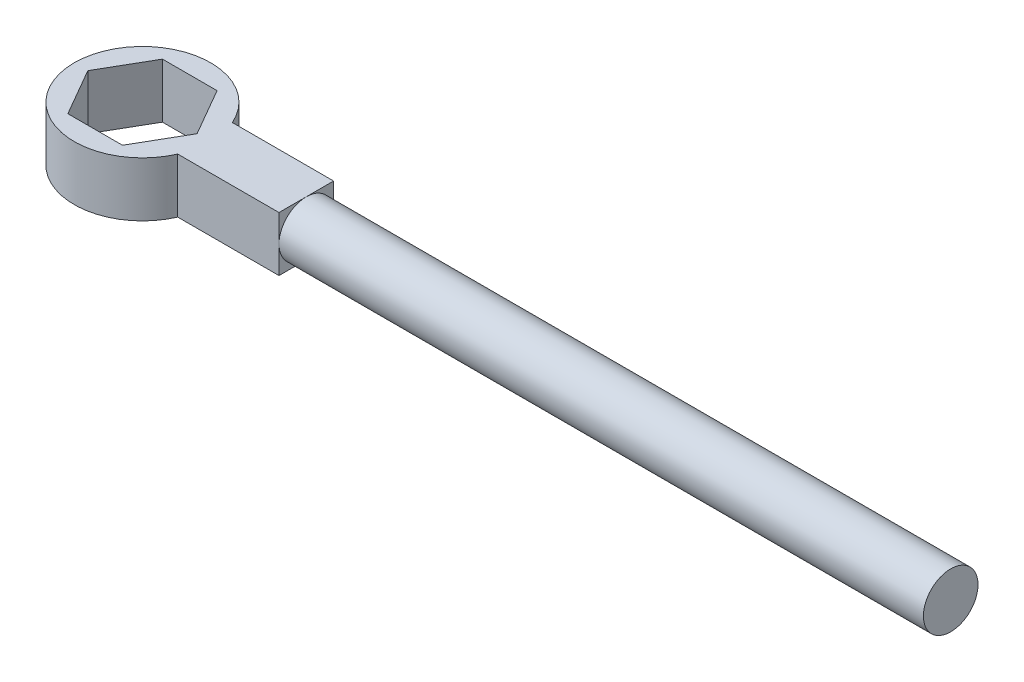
from build123d import *
from build123d.topology import SkipClean

# Parameters (mm, degrees)
SKETCH1_R                            = 1.25
BOSS_EXTRUDE1_DEPTH                  = 1
SKETCH2_R                            = 0.5
BOSS_EXTRUDE2_DEPTH                  = 13.3
BOSS_EXTRUDE2_DIRECTION_2_REACH      = 5.182
BOSS_EXTRUDE2_DIRECTION_2_END_RADIUS = 1.25
SKETCH3_W                            = 1
SKETCH3_H                            = 1
BOSS_EXTRUDE3_DEPTH                  = 1.5
BOSS_EXTRUDE3_DIRECTION_2_REACH      = 15.396
BOSS_EXTRUDE3_DIRECTION_2_END_RADIUS = 1.25


with BuildPart() as part:
    # Sketch1 → Boss-Extrude1 (new body)
    with BuildSketch(Plane(origin=(0, 0, 0), x_dir=(1, 0, 0), z_dir=(0, 1, 0))):
        with Locations(Location((0, 0, 0), (0, 0, 270))):
            Circle(SKETCH1_R)
        Polygon((1, 0), (0.5, 0.866025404), (-0.5, 0.866025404), (-1, 0), (-0.5, -0.866025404), (0.5, -0.866025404), align=None, mode=Mode.SUBTRACT)
    extrude(amount=BOSS_EXTRUDE1_DEPTH)



with BuildPart() as body_2:
    # Sketch2 → Boss-Extrude2 (new body)
    with BuildSketch(Plane(origin=(1.5, 0, 0), x_dir=(0, 0, -1), z_dir=(1, 0, 0))):
        with Locations((0, 0.5)):
            Circle(SKETCH2_R)
    extrude(amount=BOSS_EXTRUDE2_DEPTH)

    # Boss-Extrude2 direction 2: up to this cylinder (the profile starts outside it)
    boss_extrude2_direction_2_end = Plane(origin=(0, 0.5, 0), z_dir=(0, -1, 0)) * Cylinder(BOSS_EXTRUDE2_DIRECTION_2_END_RADIUS, 13.864, mode=Mode.PRIVATE)
    # Sketch2 → Boss-Extrude2 direction 2 (add, up to the surface)
    with BuildSketch(Plane(origin=(1.5, 0, 0), x_dir=(0, 0, -1), z_dir=(1, 0, 0)), mode=Mode.PRIVATE) as boss_extrude2_direction_2_sk1:
        with Locations((0, 0.5)):
            Circle(SKETCH2_R)
    boss_extrude2_direction_2_tool1 = extrude(boss_extrude2_direction_2_sk1.sketch, amount=-BOSS_EXTRUDE2_DIRECTION_2_REACH, mode=Mode.PRIVATE) - boss_extrude2_direction_2_end
    add(boss_extrude2_direction_2_tool1.solids().sort_by_distance((1.5, 0.5, 0))[0])


with BuildPart() as part_1:
    with SkipClean():  # the faces are left unmerged after this step: merging them gives an invalid solid
        add(part.part)

        add(body_2.part)  # Boss-Extrude3 merges body 2
        # Sketch3 → Boss-Extrude3 (add)
        with BuildSketch(Plane(origin=(1.5, 0, 0), x_dir=(0, 0, -1), z_dir=(1, 0, 0))):
            with Locations((0, 0.5)):
                Rectangle(SKETCH3_W, SKETCH3_H)
        extrude(amount=BOSS_EXTRUDE3_DEPTH)

    # Boss-Extrude3 direction 2: up to this cylinder (the profile starts outside it)
    boss_extrude3_direction_2_end = Plane(origin=(0, 0.5, 0), z_dir=(0, -1, 0)) * Cylinder(BOSS_EXTRUDE3_DIRECTION_2_END_RADIUS, 34.292, mode=Mode.PRIVATE)
    # Sketch3 → Boss-Extrude3 direction 2 (add, up to the surface)
    with BuildSketch(Plane(origin=(1.5, 0, 0), x_dir=(0, 0, -1), z_dir=(1, 0, 0)), mode=Mode.PRIVATE) as boss_extrude3_direction_2_sk1:
        with Locations((0, 0.5)):
            Rectangle(SKETCH3_W, SKETCH3_H)
    boss_extrude3_direction_2_tool1 = extrude(boss_extrude3_direction_2_sk1.sketch, amount=-BOSS_EXTRUDE3_DIRECTION_2_REACH, mode=Mode.PRIVATE) - boss_extrude3_direction_2_end
    add(boss_extrude3_direction_2_tool1.solids().sort_by_distance((1.5, 0.5, 0))[0])


solid = part_1.part
